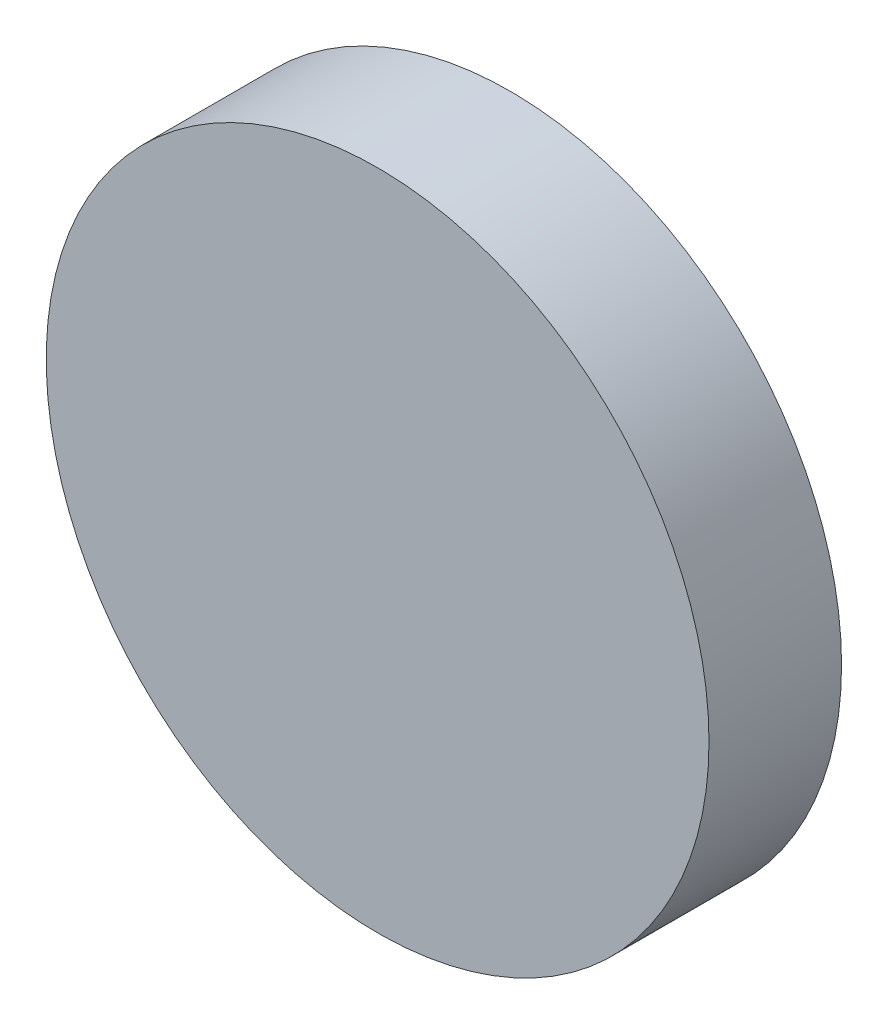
ISO-10303-21;
HEADER;
FILE_DESCRIPTION(('STEP AP214'),'2;1');
FILE_NAME('part.step','',(''),(''),'','','');
FILE_SCHEMA(('AUTOMOTIVE_DESIGN { 1 0 10303 214 1 1 1 1 }'));
ENDSEC;
DATA;
#1=APPLICATION_CONTEXT('core data for automotive mechanical design processes');
#2=APPLICATION_PROTOCOL_DEFINITION('international standard','automotive_design',2000,#1);
#3=PRODUCT_CONTEXT('',#1,'mechanical');
#4=PRODUCT('Part','Part','',(#3));
#5=PRODUCT_RELATED_PRODUCT_CATEGORY('part','',(#4));
#6=PRODUCT_DEFINITION_FORMATION('','',#4);
#7=PRODUCT_DEFINITION_CONTEXT('part definition',#1,'design');
#8=PRODUCT_DEFINITION('design','',#6,#7);
#9=PRODUCT_DEFINITION_SHAPE('','',#8);
#10=(LENGTH_UNIT() NAMED_UNIT(*) SI_UNIT(.MILLI.,.METRE.));
#11=(NAMED_UNIT(*) PLANE_ANGLE_UNIT() SI_UNIT($,.RADIAN.));
#12=(NAMED_UNIT(*) SI_UNIT($,.STERADIAN.) SOLID_ANGLE_UNIT());
#13=UNCERTAINTY_MEASURE_WITH_UNIT(LENGTH_MEASURE(1.E-05),#10,'distance_accuracy_value','');
#14=(GEOMETRIC_REPRESENTATION_CONTEXT(3) GLOBAL_UNCERTAINTY_ASSIGNED_CONTEXT((#13)) GLOBAL_UNIT_ASSIGNED_CONTEXT((#10,
#11,#12)) REPRESENTATION_CONTEXT('',''));
#15=CARTESIAN_POINT('',(0.,0.,0.));
#16=DIRECTION('',(0.,0.,1.));
#17=DIRECTION('',(1.,0.,0.));
#18=AXIS2_PLACEMENT_3D('',#15,#16,#17);
#19=CARTESIAN_POINT('',(0.,0.,2.));
#20=DIRECTION('',(0.,0.,-1.));
#21=DIRECTION('',(-1.,0.,0.));
#22=AXIS2_PLACEMENT_3D('',#19,#20,#21);
#23=CYLINDRICAL_SURFACE('',#22,5.);
#24=CARTESIAN_POINT('',(0.,0.,2.));
#25=DIRECTION('',(0.,0.,1.));
#26=DIRECTION('',(1.,0.,0.));
#27=AXIS2_PLACEMENT_3D('',#24,#25,#26);
#28=CIRCLE('',#27,5.);
#29=CARTESIAN_POINT('',(5.,0.,2.));
#30=VERTEX_POINT('',#29);
#31=EDGE_CURVE('E10',#30,#30,#28,.T.);
#32=ORIENTED_EDGE('',*,*,#31,.F.);
#33=EDGE_LOOP('',(#32));
#34=FACE_BOUND('',#33,.T.);
#35=CARTESIAN_POINT('',(0.,0.,0.));
#36=DIRECTION('',(0.,0.,1.));
#37=DIRECTION('',(1.,0.,0.));
#38=AXIS2_PLACEMENT_3D('',#35,#36,#37);
#39=CIRCLE('',#38,5.);
#40=CARTESIAN_POINT('',(5.,0.,0.));
#41=VERTEX_POINT('',#40);
#42=EDGE_CURVE('E36',#41,#41,#39,.T.);
#43=ORIENTED_EDGE('',*,*,#42,.T.);
#44=EDGE_LOOP('',(#43));
#45=FACE_BOUND('',#44,.T.);
#46=ADVANCED_FACE('F33',(#34,#45),#23,.T.);
#47=CARTESIAN_POINT('',(0.,0.,2.));
#48=DIRECTION('',(0.,0.,1.));
#49=DIRECTION('',(1.,0.,0.));
#50=AXIS2_PLACEMENT_3D('',#47,#48,#49);
#51=PLANE('',#50);
#52=ORIENTED_EDGE('',*,*,#31,.T.);
#53=EDGE_LOOP('',(#52));
#54=FACE_BOUND('',#53,.T.);
#55=ADVANCED_FACE('F62',(#54),#51,.T.);
#56=CARTESIAN_POINT('',(0.,0.,0.));
#57=DIRECTION('',(0.,0.,1.));
#58=DIRECTION('',(1.,0.,0.));
#59=AXIS2_PLACEMENT_3D('',#56,#57,#58);
#60=PLANE('',#59);
#61=CARTESIAN_POINT('',(0.,0.,0.));
#62=DIRECTION('',(0.,0.,-1.));
#63=DIRECTION('',(-1.,0.,0.));
#64=AXIS2_PLACEMENT_3D('',#61,#62,#63);
#65=CIRCLE('',#64,4.);
#66=CARTESIAN_POINT('',(-4.,0.,0.));
#67=VERTEX_POINT('',#66);
#68=EDGE_CURVE('E45',#67,#67,#65,.T.);
#69=ORIENTED_EDGE('',*,*,#68,.F.);
#70=EDGE_LOOP('',(#69));
#71=FACE_BOUND('',#70,.T.);
#72=ORIENTED_EDGE('',*,*,#42,.F.);
#73=EDGE_LOOP('',(#72));
#74=FACE_BOUND('',#73,.T.);
#75=ADVANCED_FACE('F56',(#71,#74),#60,.F.);
#76=CARTESIAN_POINT('',(0.,0.,1.));
#77=DIRECTION('',(0.,0.,-1.));
#78=DIRECTION('',(-1.,0.,0.));
#79=AXIS2_PLACEMENT_3D('',#76,#77,#78);
#80=CYLINDRICAL_SURFACE('',#79,4.);
#81=CARTESIAN_POINT('',(0.,0.,1.));
#82=DIRECTION('',(0.,0.,-1.));
#83=DIRECTION('',(-1.,0.,0.));
#84=AXIS2_PLACEMENT_3D('',#81,#82,#83);
#85=CIRCLE('',#84,4.);
#86=CARTESIAN_POINT('',(-4.,0.,1.));
#87=VERTEX_POINT('',#86);
#88=EDGE_CURVE('E43',#87,#87,#85,.T.);
#89=ORIENTED_EDGE('',*,*,#88,.F.);
#90=EDGE_LOOP('',(#89));
#91=FACE_BOUND('',#90,.T.);
#92=ORIENTED_EDGE('',*,*,#68,.T.);
#93=EDGE_LOOP('',(#92));
#94=FACE_BOUND('',#93,.T.);
#95=ADVANCED_FACE('F53',(#91,#94),#80,.F.);
#96=CARTESIAN_POINT('',(0.,0.,1.));
#97=DIRECTION('',(0.,0.,-1.));
#98=DIRECTION('',(-1.,0.,0.));
#99=AXIS2_PLACEMENT_3D('',#96,#97,#98);
#100=PLANE('',#99);
#101=ORIENTED_EDGE('',*,*,#88,.T.);
#102=EDGE_LOOP('',(#101));
#103=FACE_BOUND('',#102,.T.);
#104=ADVANCED_FACE('F51',(#103),#100,.T.);
#105=CLOSED_SHELL('',(#46,#55,#75,#95,#104));
#106=MANIFOLD_SOLID_BREP('B2',#105);
#107=ADVANCED_BREP_SHAPE_REPRESENTATION('',(#18,#106),#14);
#108=SHAPE_DEFINITION_REPRESENTATION(#9,#107);
ENDSEC;
END-ISO-10303-21;
